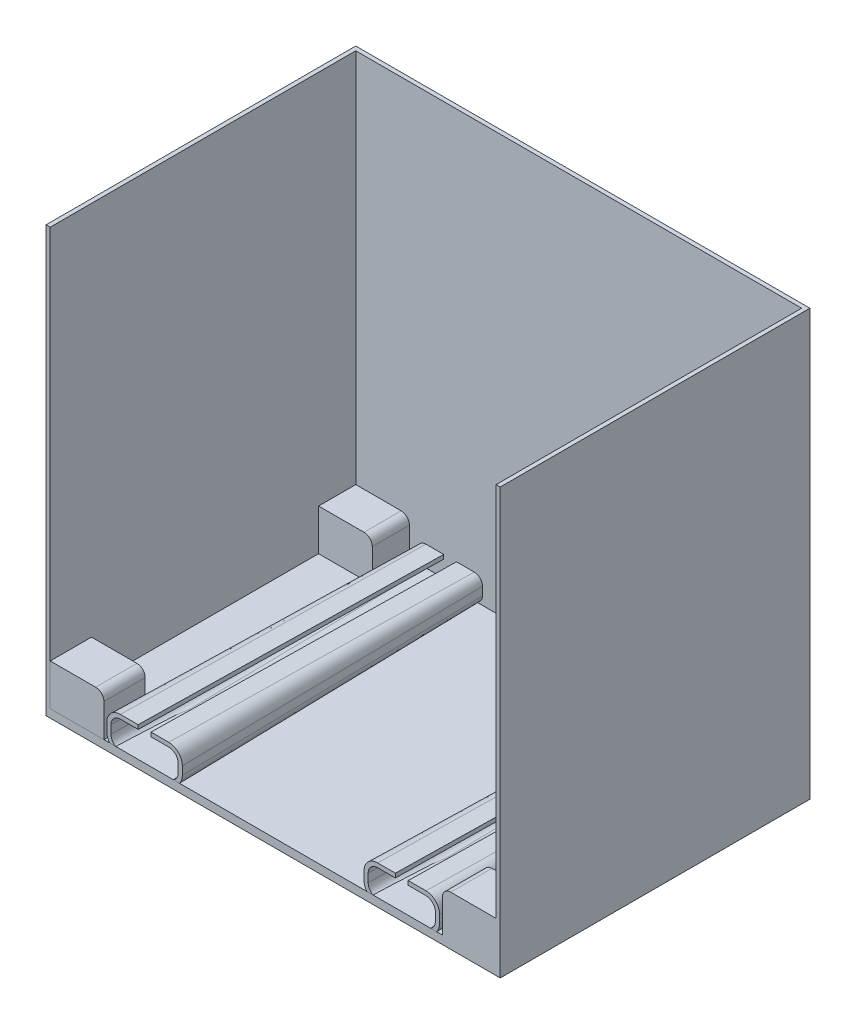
from build123d import *

# Parameters (mm, degrees)
SKETCH1_W                                = 110
SKETCH1_H                                = 75
BOSS_EXTRUDE1_DEPTH                      = 51.5
SHELL1_T                                 = -1
SHELL1_THICKNESS_2_FACE_W                = 74
SHELL1_THICKNESS_2_FACE_H                = 108
SHELL1_THICKNESS_2_DEPTH                 = 1
BOSS_EXTRUDE4_DEPTH                      = 74
BOSS_EXTRUDE4_DRAFT                      = -1
BOSS_EXTRUDE4_PROFILE_2_DEPTH            = 74
BOSS_EXTRUDE4_PROFILE_2_DRAFT            = -1
SHELL3_T                                 = 1
SHELL4_T                                 = 1
SKETCH4_W                                = 3.1
SKETCH4_H                                = 3
CUT_EXTRUDE1_DEPTH                       = 74
BOSS_EXTRUDE5_DEPTH                      = 10
MIRROR5_AT_THE_SECOND_PLANE_COPY_1_DEPTH = 10
F_6_0_204_DIAMETER_HOLE1_AT_2_COUNT      = 2
F_6_0_204_DIAMETER_HOLE1_AT_2_PITCH      = 63
F_6_0_204_DIAMETER_HOLE1_AT_3_COUNT      = 2
F_6_0_204_DIAMETER_HOLE1_AT_3_PITCH      = 113.159179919
F_6_0_204_DIAMETER_HOLE1_AT_4_COUNT      = 2
F_6_0_204_DIAMETER_HOLE1_AT_4_PITCH      = 94


with BuildPart() as part:
    # Sketch1 → Boss-Extrude1 (new, symmetric)
    with BuildSketch(Plane(origin=(0, 0, 0), x_dir=(1, 0, 0), z_dir=(0, 1, 0))):
        Rectangle(SKETCH1_W, SKETCH1_H)
    extrude(amount=BOSS_EXTRUDE1_DEPTH, both=True)

    # Shell1
    shell1_openings = [part.faces().sort_by_distance(p)[0] for p in [
        (0, 51.5, 0),
        (0, 0, 37.5),
    ]]
    offset(amount=SHELL1_T, openings=shell1_openings, kind=Kind.INTERSECTION)

    # Shell1 thickness 2 face (on inner face of the shell) → Shell1 thickness 2 (add)
    with BuildSketch(Plane(origin=(0, -50.5, 0.5), x_dir=(0, 0, -1), z_dir=(0, -1, 0))):
        Rectangle(SHELL1_THICKNESS_2_FACE_W, SHELL1_THICKNESS_2_FACE_H)
    extrude(amount=-SHELL1_THICKNESS_2_DEPTH)


with BuildPart() as body_2:
    # Sketch3 → Boss-Extrude4 (with draft: the straight prism first)
    with BuildSketch(Plane.XY.offset(-36.5)):
        with BuildLine():
            Line((-37, -48.5), (-25.3, -48.5))
            ThreePointArc((-25.3, -48.5), (-24.592893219, -48.207106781), (-24.3, -47.5))
            Line((-24.3, -47.5), (-24.3, -45.5))
            ThreePointArc((-24.3, -45.5), (-24.592893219, -44.792893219), (-25.3, -44.5))
            Line((-25.3, -44.5), (-37, -44.5))
            ThreePointArc((-37, -44.5), (-37.707106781, -44.792893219), (-38, -45.5))
            Line((-38, -45.5), (-38, -47.5))
            ThreePointArc((-38, -47.5), (-37.707106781, -48.207106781), (-37, -48.5))
        make_face()
    extrude(amount=BOSS_EXTRUDE4_DEPTH)
    # Boss-Extrude4: the draft: its side faces are tilted about the plane it starts from
    boss_extrude4_sides = [body_2.faces().sort_by_distance(p)[0] for p in [
        (-31.15, -48.5, 0.5),
        (-24.592893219, -48.207106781, 0.5),
        (-24.3, -46.5, 0.5),
        (-24.592893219, -44.792893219, 0.5),
        (-31.15, -44.5, 0.5),
        (-37.707106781, -44.792893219, 0.5),
        (-38, -46.5, 0.5),
        (-37.707106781, -48.207106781, 0.5),
    ]]
    draft(boss_extrude4_sides, Plane.XY.offset(-36.5), BOSS_EXTRUDE4_DRAFT)

    # Shell3
    shell3_openings = [body_2.faces().sort_by_distance(p)[0] for p in [
        (-31.15, -46.5, 37.5),
    ]]
    offset(amount=SHELL3_T, openings=shell3_openings, kind=Kind.INTERSECTION)


with BuildPart() as body_3:
    # Sketch3 → Boss-Extrude4 profile 2 (with draft: the straight prism first)
    with BuildSketch(Plane.XY.offset(-36.5)):
        with BuildLine():
            Line((37, -44.5), (25.3, -44.5))
            ThreePointArc((25.3, -44.5), (24.592893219, -44.792893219), (24.3, -45.5))
            Line((24.3, -45.5), (24.3, -47.5))
            ThreePointArc((24.3, -47.5), (24.592893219, -48.207106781), (25.3, -48.5))
            Line((25.3, -48.5), (37, -48.5))
            ThreePointArc((37, -48.5), (37.707106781, -48.207106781), (38, -47.5))
            Line((38, -47.5), (38, -45.5))
            ThreePointArc((38, -45.5), (37.707106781, -44.792893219), (37, -44.5))
        make_face()
    extrude(amount=BOSS_EXTRUDE4_PROFILE_2_DEPTH)
    # Boss-Extrude4 profile 2: the draft: its side faces are tilted about the plane it starts from
    boss_extrude4_profile_2_sides = [body_3.faces().sort_by_distance(p)[0] for p in [
        (31.15, -44.5, 0.5),
        (24.592893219, -44.792893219, 0.5),
        (24.3, -46.5, 0.5),
        (24.592893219, -48.207106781, 0.5),
        (31.15, -48.5, 0.5),
        (37.707106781, -48.207106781, 0.5),
        (38, -46.5, 0.5),
        (37.707106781, -44.792893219, 0.5),
    ]]
    draft(boss_extrude4_profile_2_sides, Plane.XY.offset(-36.5), BOSS_EXTRUDE4_PROFILE_2_DRAFT)

    # Shell4
    shell4_openings = [body_3.faces().sort_by_distance(p)[0] for p in [
        (31.15, -46.5, 37.5),
    ]]
    offset(amount=SHELL4_T, openings=shell4_openings, kind=Kind.INTERSECTION)


with BuildPart() as cut_extrude1_tool:
    # Sketch4 → Cut-Extrude1 (new body)
    with BuildSketch(Plane.XY.offset(37.5)):
        with Locations((-31.15, -43.208325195)):
            Rectangle(SKETCH4_W, SKETCH4_H)
        with Locations((31.15, -43.208325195)):
            Rectangle(SKETCH4_W, SKETCH4_H)
    extrude(amount=-CUT_EXTRUDE1_DEPTH)


with BuildPart() as body_2_1:
    add(body_2.part)

    # Cut-Extrude1: cut by cut_extrude1_tool
    add(cut_extrude1_tool.part, mode=Mode.SUBTRACT)


with BuildPart() as body_3_1:
    add(body_3.part)

    # Cut-Extrude1: cut by cut_extrude1_tool
    add(cut_extrude1_tool.part, mode=Mode.SUBTRACT)


with BuildPart() as body_4:
    # Sketch5 → Boss-Extrude5 (new body)
    with BuildSketch(Plane.XY.offset(37.5)):
        with BuildLine():
            Line((-54, -49.5), (-41, -49.5))
            Line((-41, -49.5), (-41, -41.5))
            ThreePointArc((-41, -41.5), (-41.585786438, -40.085786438), (-43, -39.5))
            Line((-43, -39.5), (-54, -39.5))
            Line((-54, -39.5), (-54, -49.5))
        make_face()
    boss_extrude5 = extrude(amount=-BOSS_EXTRUDE5_DEPTH)


with BuildPart() as part_1:
    add(part.part)

    # Mirror5: Boss-Extrude5 across plane
    add(boss_extrude5.mirror(Plane.XY))

    # Mirror5 at the second plane: Boss-Extrude5 across plane
    add(boss_extrude5.mirror(Plane(origin=(0, 0, 0), x_dir=(0, 0, 1), z_dir=(1, 0, 0))))

    # Mirror5 at the second plane copy 1 sketc → Mirror5 at the second plane copy 1 (add)
    with BuildSketch(Plane(origin=(0, 0, -37.5), x_dir=(-1, 0, 0), z_dir=(0, 0, -1))):
        with BuildLine():
            Line((-54, -49.5), (-41, -49.5))
            Line((-41, -49.5), (-41, -41.5))
            ThreePointArc((-41, -41.5), (-41.585786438, -40.085786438), (-43, -39.5))
            Line((-43, -39.5), (-54, -39.5))
            Line((-54, -39.5), (-54, -49.5))
        make_face()
    extrude(amount=-MIRROR5_AT_THE_SECOND_PLANE_COPY_1_DEPTH)


with BuildPart() as f_6_0_204_diameter_hole1_tool:
    # Sketch8 → 6 _0.204_ Diameter Hole1 (revolve)
    with BuildSketch(Plane(origin=(-47, -51.5, 31.5), x_dir=(0, 0, -1), z_dir=(1, 0, 0))):
        Polygon((0, 0), (0, 8), (2.5908, 6.443290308), (2.5908, 0), align=None)
    f_6_0_204_diameter_hole1 = revolve(axis=Axis((-47, -57.85, 31.5), (0, 1, 0)))


with BuildPart() as part_2:
    add(part_1.part)

    # 6 _0.204_ Diameter Hole1: cut by f_6_0_204_diameter_hole1_tool
    add(f_6_0_204_diameter_hole1_tool.part, mode=Mode.SUBTRACT)

    # 6 _0.204_ Diameter Hole1 at 2: 6 _0.204_ Diameter Hole1 ×2
    with Locations(*[(0, 0, -i * F_6_0_204_DIAMETER_HOLE1_AT_2_PITCH) for i in range(1, F_6_0_204_DIAMETER_HOLE1_AT_2_COUNT)]):
        add(f_6_0_204_diameter_hole1, mode=Mode.SUBTRACT)

    # 6 _0.204_ Diameter Hole1 at 3: 6 _0.204_ Diameter Hole1 ×2
    with Locations(*[Vector(0.8306882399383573, 0, -0.5567378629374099) * (i * F_6_0_204_DIAMETER_HOLE1_AT_3_PITCH) for i in range(1, F_6_0_204_DIAMETER_HOLE1_AT_3_COUNT)]):
        add(f_6_0_204_diameter_hole1, mode=Mode.SUBTRACT)

    # 6 _0.204_ Diameter Hole1 at 4: 6 _0.204_ Diameter Hole1 ×2
    with Locations(*[(i * F_6_0_204_DIAMETER_HOLE1_AT_4_PITCH, 0, 0) for i in range(1, F_6_0_204_DIAMETER_HOLE1_AT_4_COUNT)]):
        add(f_6_0_204_diameter_hole1, mode=Mode.SUBTRACT)


with BuildPart() as body_4_1:
    add(body_4.part)

    # 6 _0.204_ Diameter Hole1: cut by f_6_0_204_diameter_hole1_tool
    add(f_6_0_204_diameter_hole1_tool.part, mode=Mode.SUBTRACT)


solid = Compound([body_2_1.part, body_3_1.part, part_2.part, body_4_1.part])
